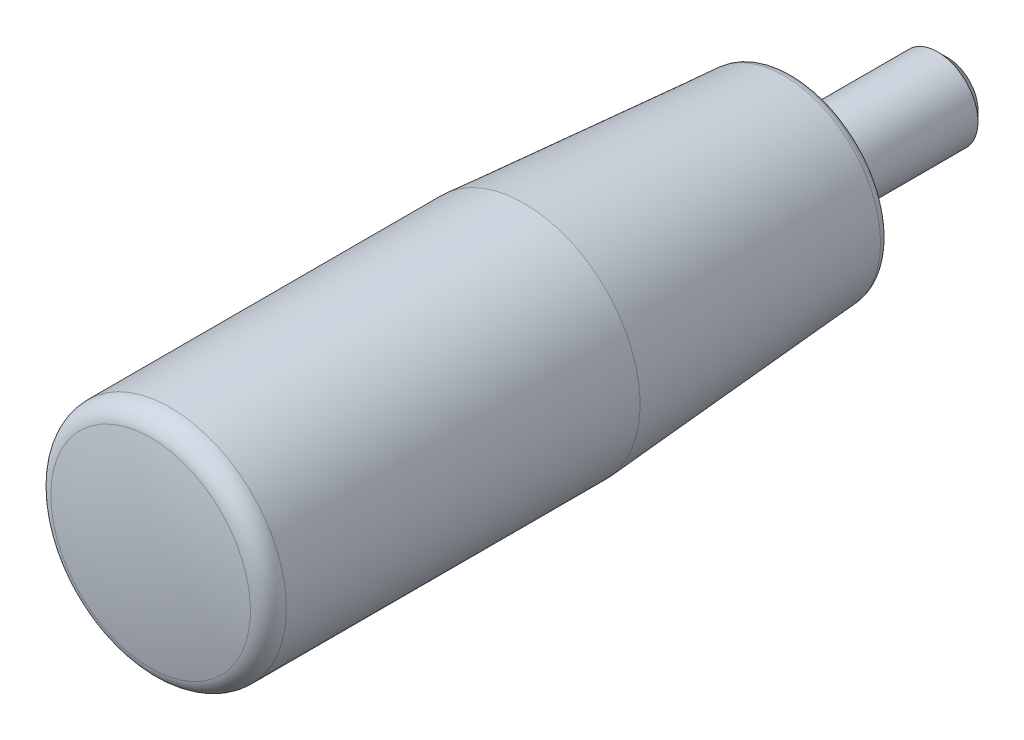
ISO-10303-21;
HEADER;
FILE_DESCRIPTION(('STEP AP214'),'2;1');
FILE_NAME('part.step','',(''),(''),'','','');
FILE_SCHEMA(('AUTOMOTIVE_DESIGN { 1 0 10303 214 1 1 1 1 }'));
ENDSEC;
DATA;
#1=APPLICATION_CONTEXT('core data for automotive mechanical design processes');
#2=APPLICATION_PROTOCOL_DEFINITION('international standard','automotive_design',2000,#1);
#3=PRODUCT_CONTEXT('',#1,'mechanical');
#4=PRODUCT('Part','Part','',(#3));
#5=PRODUCT_RELATED_PRODUCT_CATEGORY('part','',(#4));
#6=PRODUCT_DEFINITION_FORMATION('','',#4);
#7=PRODUCT_DEFINITION_CONTEXT('part definition',#1,'design');
#8=PRODUCT_DEFINITION('design','',#6,#7);
#9=PRODUCT_DEFINITION_SHAPE('','',#8);
#10=(LENGTH_UNIT() NAMED_UNIT(*) SI_UNIT(.MILLI.,.METRE.));
#11=(NAMED_UNIT(*) PLANE_ANGLE_UNIT() SI_UNIT($,.RADIAN.));
#12=(NAMED_UNIT(*) SI_UNIT($,.STERADIAN.) SOLID_ANGLE_UNIT());
#13=UNCERTAINTY_MEASURE_WITH_UNIT(LENGTH_MEASURE(1.E-05),#10,'distance_accuracy_value','');
#14=(GEOMETRIC_REPRESENTATION_CONTEXT(3) GLOBAL_UNCERTAINTY_ASSIGNED_CONTEXT((#13)) GLOBAL_UNIT_ASSIGNED_CONTEXT((#10,
#11,#12)) REPRESENTATION_CONTEXT('',''));
#15=CARTESIAN_POINT('',(0.,0.,0.));
#16=DIRECTION('',(0.,0.,1.));
#17=DIRECTION('',(1.,0.,0.));
#18=AXIS2_PLACEMENT_3D('',#15,#16,#17);
#19=CARTESIAN_POINT('',(0.,0.,62.050504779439));
#20=DIRECTION('',(0.,0.,-1.));
#21=DIRECTION('',(-1.,0.,0.));
#22=AXIS2_PLACEMENT_3D('',#19,#20,#21);
#23=TOROIDAL_SURFACE('',#22,9.5,2.);
#24=CARTESIAN_POINT('',(0.,0.,62.050504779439));
#25=DIRECTION('',(0.,0.,-1.));
#26=DIRECTION('',(-1.,0.,0.));
#27=AXIS2_PLACEMENT_3D('',#24,#25,#26);
#28=CIRCLE('',#27,11.5);
#29=CARTESIAN_POINT('',(-11.5,0.,62.050504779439));
#30=VERTEX_POINT('',#29);
#31=EDGE_CURVE('E142',#30,#30,#28,.T.);
#32=ORIENTED_EDGE('',*,*,#31,.F.);
#33=EDGE_LOOP('',(#32));
#34=FACE_BOUND('',#33,.T.);
#35=CARTESIAN_POINT('',(0.,0.,64.010942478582));
#36=DIRECTION('',(0.,0.,-1.));
#37=DIRECTION('',(-1.,0.,0.));
#38=AXIS2_PLACEMENT_3D('',#35,#36,#37);
#39=CIRCLE('',#38,9.89583333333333);
#40=CARTESIAN_POINT('',(-9.89583333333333,0.,64.010942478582));
#41=VERTEX_POINT('',#40);
#42=EDGE_CURVE('E116',#41,#41,#39,.T.);
#43=ORIENTED_EDGE('',*,*,#42,.T.);
#44=EDGE_LOOP('',(#43));
#45=FACE_BOUND('',#44,.T.);
#46=ADVANCED_FACE('F14',(#34,#45),#23,.T.);
#47=CARTESIAN_POINT('',(0.,0.,-20.));
#48=DIRECTION('',(0.,0.,-1.));
#49=DIRECTION('',(-1.,0.,0.));
#50=AXIS2_PLACEMENT_3D('',#47,#48,#49);
#51=CYLINDRICAL_SURFACE('',#50,11.5);
#52=CARTESIAN_POINT('',(0.,0.,27.));
#53=DIRECTION('',(0.,0.,-1.));
#54=DIRECTION('',(-1.,0.,0.));
#55=AXIS2_PLACEMENT_3D('',#52,#53,#54);
#56=CIRCLE('',#55,11.5);
#57=CARTESIAN_POINT('',(-11.5,0.,27.));
#58=VERTEX_POINT('',#57);
#59=EDGE_CURVE('E139',#58,#58,#56,.T.);
#60=ORIENTED_EDGE('',*,*,#59,.F.);
#61=EDGE_LOOP('',(#60));
#62=FACE_BOUND('',#61,.T.);
#63=ORIENTED_EDGE('',*,*,#31,.T.);
#64=EDGE_LOOP('',(#63));
#65=FACE_BOUND('',#64,.T.);
#66=ADVANCED_FACE('F165',(#62,#65),#51,.T.);
#67=CARTESIAN_POINT('',(0.,0.,1.22530100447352));
#68=DIRECTION('',(0.,0.,1.));
#69=DIRECTION('',(1.,0.,0.));
#70=AXIS2_PLACEMENT_3D('',#67,#68,#69);
#71=CONICAL_SURFACE('',#70,9.56931093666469,0.0747667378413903);
#72=ORIENTED_EDGE('',*,*,#59,.T.);
#73=EDGE_LOOP('',(#72));
#74=FACE_BOUND('',#73,.T.);
#75=CARTESIAN_POINT('',(0.,0.,1.22530100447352));
#76=DIRECTION('',(0.,0.,-1.));
#77=DIRECTION('',(-1.,0.,0.));
#78=AXIS2_PLACEMENT_3D('',#75,#76,#77);
#79=CIRCLE('',#78,9.56931093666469);
#80=CARTESIAN_POINT('',(-9.56931093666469,0.,1.22530100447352));
#81=VERTEX_POINT('',#80);
#82=EDGE_CURVE('E136',#81,#81,#79,.T.);
#83=ORIENTED_EDGE('',*,*,#82,.F.);
#84=EDGE_LOOP('',(#83));
#85=FACE_BOUND('',#84,.T.);
#86=ADVANCED_FACE('F171',(#74,#85),#71,.T.);
#87=CARTESIAN_POINT('',(0.,0.,1.3));
#88=DIRECTION('',(0.,0.,-1.));
#89=DIRECTION('',(-1.,0.,0.));
#90=AXIS2_PLACEMENT_3D('',#87,#88,#89);
#91=TOROIDAL_SURFACE('',#90,8.57210480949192,1.00000000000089);
#92=CARTESIAN_POINT('',(0.,0.,0.299999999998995));
#93=DIRECTION('',(0.,0.,-1.));
#94=DIRECTION('',(-1.,0.,0.));
#95=AXIS2_PLACEMENT_3D('',#92,#93,#94);
#96=CIRCLE('',#95,8.57210480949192);
#97=CARTESIAN_POINT('',(-8.57210480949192,0.,0.299999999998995));
#98=VERTEX_POINT('',#97);
#99=EDGE_CURVE('E133',#98,#98,#96,.T.);
#100=ORIENTED_EDGE('',*,*,#99,.F.);
#101=EDGE_LOOP('',(#100));
#102=FACE_BOUND('',#101,.T.);
#103=ORIENTED_EDGE('',*,*,#82,.T.);
#104=EDGE_LOOP('',(#103));
#105=FACE_BOUND('',#104,.T.);
#106=ADVANCED_FACE('F179',(#102,#105),#91,.T.);
#107=CARTESIAN_POINT('',(0.,6.,0.299999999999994));
#108=DIRECTION('',(0.,0.,-1.));
#109=DIRECTION('',(-1.,0.,0.));
#110=AXIS2_PLACEMENT_3D('',#107,#108,#109);
#111=PLANE('',#110);
#112=ORIENTED_EDGE('',*,*,#99,.T.);
#113=EDGE_LOOP('',(#112));
#114=FACE_BOUND('',#113,.T.);
#115=CARTESIAN_POINT('',(0.,0.,0.299999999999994));
#116=DIRECTION('',(0.,0.,-1.));
#117=DIRECTION('',(-1.,0.,0.));
#118=AXIS2_PLACEMENT_3D('',#115,#116,#117);
#119=CIRCLE('',#118,6.);
#120=CARTESIAN_POINT('',(-6.,0.,0.299999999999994));
#121=VERTEX_POINT('',#120);
#122=EDGE_CURVE('E130',#121,#121,#119,.T.);
#123=ORIENTED_EDGE('',*,*,#122,.F.);
#124=EDGE_LOOP('',(#123));
#125=FACE_BOUND('',#124,.T.);
#126=ADVANCED_FACE('F183',(#114,#125),#111,.T.);
#127=CARTESIAN_POINT('',(0.,0.,-20.));
#128=DIRECTION('',(0.,0.,-1.));
#129=DIRECTION('',(-1.,0.,0.));
#130=AXIS2_PLACEMENT_3D('',#127,#128,#129);
#131=CYLINDRICAL_SURFACE('',#130,6.);
#132=ORIENTED_EDGE('',*,*,#122,.T.);
#133=EDGE_LOOP('',(#132));
#134=FACE_BOUND('',#133,.T.);
#135=CARTESIAN_POINT('',(0.,0.,0.));
#136=DIRECTION('',(0.,0.,-1.));
#137=DIRECTION('',(-1.,0.,0.));
#138=AXIS2_PLACEMENT_3D('',#135,#136,#137);
#139=CIRCLE('',#138,6.);
#140=CARTESIAN_POINT('',(-6.,0.,0.));
#141=VERTEX_POINT('',#140);
#142=EDGE_CURVE('E127',#141,#141,#139,.T.);
#143=ORIENTED_EDGE('',*,*,#142,.F.);
#144=EDGE_LOOP('',(#143));
#145=FACE_BOUND('',#144,.T.);
#146=ADVANCED_FACE('F187',(#134,#145),#131,.T.);
#147=CARTESIAN_POINT('',(0.,6.,0.));
#148=DIRECTION('',(0.,0.,1.));
#149=DIRECTION('',(1.,0.,0.));
#150=AXIS2_PLACEMENT_3D('',#147,#148,#149);
#151=PLANE('',#150);
#152=CARTESIAN_POINT('',(0.,0.,0.));
#153=DIRECTION('',(0.,0.,-1.));
#154=DIRECTION('',(-1.,0.,0.));
#155=AXIS2_PLACEMENT_3D('',#152,#153,#154);
#156=CIRCLE('',#155,4.);
#157=CARTESIAN_POINT('',(-4.,0.,0.));
#158=VERTEX_POINT('',#157);
#159=EDGE_CURVE('E124',#158,#158,#156,.T.);
#160=ORIENTED_EDGE('',*,*,#159,.F.);
#161=EDGE_LOOP('',(#160));
#162=FACE_BOUND('',#161,.T.);
#163=ORIENTED_EDGE('',*,*,#142,.T.);
#164=EDGE_LOOP('',(#163));
#165=FACE_BOUND('',#164,.T.);
#166=ADVANCED_FACE('F191',(#162,#165),#151,.F.);
#167=CARTESIAN_POINT('',(0.,0.,-20.));
#168=DIRECTION('',(0.,0.,-1.));
#169=DIRECTION('',(-1.,0.,0.));
#170=AXIS2_PLACEMENT_3D('',#167,#168,#169);
#171=CYLINDRICAL_SURFACE('',#170,4.);
#172=CARTESIAN_POINT('',(0.,0.,-14.));
#173=DIRECTION('',(0.,0.,1.));
#174=DIRECTION('',(1.,0.,0.));
#175=AXIS2_PLACEMENT_3D('',#172,#173,#174);
#176=CIRCLE('',#175,4.);
#177=CARTESIAN_POINT('',(4.,0.,-14.));
#178=VERTEX_POINT('',#177);
#179=EDGE_CURVE('E9',#178,#178,#176,.T.);
#180=ORIENTED_EDGE('',*,*,#179,.T.);
#181=EDGE_LOOP('',(#180));
#182=FACE_BOUND('',#181,.T.);
#183=ORIENTED_EDGE('',*,*,#159,.T.);
#184=EDGE_LOOP('',(#183));
#185=FACE_BOUND('',#184,.T.);
#186=ADVANCED_FACE('F195',(#182,#185),#171,.T.);
#187=CARTESIAN_POINT('',(0.,4.,-15.));
#188=DIRECTION('',(0.,0.,1.));
#189=DIRECTION('',(1.,0.,0.));
#190=AXIS2_PLACEMENT_3D('',#187,#188,#189);
#191=PLANE('',#190);
#192=DIRECTION('',(-0.866025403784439,0.5,0.));
#193=VECTOR('',#192,1.);
#194=CARTESIAN_POINT('',(0.,-2.30940107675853,-15.));
#195=LINE('',#194,#193);
#196=CARTESIAN_POINT('',(0.,-2.30940107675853,-15.));
#197=VERTEX_POINT('',#196);
#198=CARTESIAN_POINT('',(-2.,-1.15470053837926,-15.));
#199=VERTEX_POINT('',#198);
#200=EDGE_CURVE('E103',#197,#199,#195,.T.);
#201=ORIENTED_EDGE('',*,*,#200,.F.);
#202=DIRECTION('',(-0.866025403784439,-0.5,0.));
#203=VECTOR('',#202,1.);
#204=CARTESIAN_POINT('',(2.,-1.15470053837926,-15.));
#205=LINE('',#204,#203);
#206=CARTESIAN_POINT('',(2.,-1.15470053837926,-15.));
#207=VERTEX_POINT('',#206);
#208=EDGE_CURVE('E29',#207,#197,#205,.T.);
#209=ORIENTED_EDGE('',*,*,#208,.F.);
#210=DIRECTION('',(0.,-1.,0.));
#211=VECTOR('',#210,1.);
#212=CARTESIAN_POINT('',(2.,1.15470053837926,-15.));
#213=LINE('',#212,#211);
#214=CARTESIAN_POINT('',(2.,1.15470053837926,-15.));
#215=VERTEX_POINT('',#214);
#216=EDGE_CURVE('E112',#215,#207,#213,.T.);
#217=ORIENTED_EDGE('',*,*,#216,.F.);
#218=DIRECTION('',(0.866025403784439,-0.5,0.));
#219=VECTOR('',#218,1.);
#220=CARTESIAN_POINT('',(0.,2.30940107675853,-15.));
#221=LINE('',#220,#219);
#222=CARTESIAN_POINT('',(0.,2.30940107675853,-15.));
#223=VERTEX_POINT('',#222);
#224=EDGE_CURVE('E110',#223,#215,#221,.T.);
#225=ORIENTED_EDGE('',*,*,#224,.F.);
#226=DIRECTION('',(0.866025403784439,0.5,0.));
#227=VECTOR('',#226,1.);
#228=CARTESIAN_POINT('',(-2.,1.15470053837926,-15.));
#229=LINE('',#228,#227);
#230=CARTESIAN_POINT('',(-2.,1.15470053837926,-15.));
#231=VERTEX_POINT('',#230);
#232=EDGE_CURVE('E77',#231,#223,#229,.T.);
#233=ORIENTED_EDGE('',*,*,#232,.F.);
#234=DIRECTION('',(0.,1.,0.));
#235=VECTOR('',#234,1.);
#236=CARTESIAN_POINT('',(-2.,-1.15470053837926,-15.));
#237=LINE('',#236,#235);
#238=EDGE_CURVE('E106',#199,#231,#237,.T.);
#239=ORIENTED_EDGE('',*,*,#238,.F.);
#240=EDGE_LOOP('',(#201,#209,#217,#225,#233,#239));
#241=FACE_BOUND('',#240,.T.);
#242=CARTESIAN_POINT('',(0.,0.,-15.));
#243=DIRECTION('',(0.,0.,1.));
#244=DIRECTION('',(1.,0.,0.));
#245=AXIS2_PLACEMENT_3D('',#242,#243,#244);
#246=CIRCLE('',#245,3.);
#247=CARTESIAN_POINT('',(3.,0.,-15.));
#248=VERTEX_POINT('',#247);
#249=EDGE_CURVE('E22',#248,#248,#246,.F.);
#250=ORIENTED_EDGE('',*,*,#249,.T.);
#251=EDGE_LOOP('',(#250));
#252=FACE_BOUND('',#251,.T.);
#253=ADVANCED_FACE('F147',(#241,#252),#191,.F.);
#254=CARTESIAN_POINT('',(0.,0.,15.));
#255=DIRECTION('',(-1.,0.,0.));
#256=DIRECTION('',(0.,0.,1.));
#257=AXIS2_PLACEMENT_3D('',#254,#255,#256);
#258=SPHERICAL_SURFACE('',#257,50.);
#259=CARTESIAN_POINT('',(0.,0.,15.));
#260=DIRECTION('',(0.,0.,-1.));
#261=DIRECTION('',(-1.,0.,0.));
#262=AXIS2_PLACEMENT_3D('',#259,#260,#261);
#263=SPHERICAL_SURFACE('',#262,50.);
#264=ORIENTED_EDGE('',*,*,#42,.F.);
#265=EDGE_LOOP('',(#264));
#266=FACE_BOUND('',#265,.T.);
#267=ADVANCED_FACE('F151',(#266),#263,.T.);
#268=CARTESIAN_POINT('',(0.,0.,-15.));
#269=DIRECTION('',(0.,0.,1.));
#270=DIRECTION('',(1.,0.,0.));
#271=AXIS2_PLACEMENT_3D('',#268,#269,#270);
#272=CONICAL_SURFACE('',#271,3.,0.785398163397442);
#273=ORIENTED_EDGE('',*,*,#179,.F.);
#274=EDGE_LOOP('',(#273));
#275=FACE_BOUND('',#274,.T.);
#276=ORIENTED_EDGE('',*,*,#249,.F.);
#277=EDGE_LOOP('',(#276));
#278=FACE_BOUND('',#277,.T.);
#279=ADVANCED_FACE('F16',(#275,#278),#272,.T.);
#280=CARTESIAN_POINT('',(2.,-1.15470053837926,-11.));
#281=DIRECTION('',(0.5,-0.866025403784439,0.));
#282=DIRECTION('',(0.866025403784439,0.5,0.));
#283=AXIS2_PLACEMENT_3D('',#280,#281,#282);
#284=PLANE('',#283);
#285=ORIENTED_EDGE('',*,*,#208,.T.);
#286=DIRECTION('',(0.,0.,-1.));
#287=VECTOR('',#286,1.);
#288=CARTESIAN_POINT('',(0.,-2.30940107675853,-11.));
#289=LINE('',#288,#287);
#290=CARTESIAN_POINT('',(0.,-2.30940107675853,-11.));
#291=VERTEX_POINT('',#290);
#292=EDGE_CURVE('E59',#291,#197,#289,.T.);
#293=ORIENTED_EDGE('',*,*,#292,.F.);
#294=DIRECTION('',(-0.866025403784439,-0.5,0.));
#295=VECTOR('',#294,1.);
#296=CARTESIAN_POINT('',(2.,-1.15470053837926,-11.));
#297=LINE('',#296,#295);
#298=CARTESIAN_POINT('',(2.,-1.15470053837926,-11.));
#299=VERTEX_POINT('',#298);
#300=EDGE_CURVE('E114',#299,#291,#297,.T.);
#301=ORIENTED_EDGE('',*,*,#300,.F.);
#302=DIRECTION('',(0.,0.,-1.));
#303=VECTOR('',#302,1.);
#304=CARTESIAN_POINT('',(2.,-1.15470053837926,-11.));
#305=LINE('',#304,#303);
#306=EDGE_CURVE('E37',#299,#207,#305,.T.);
#307=ORIENTED_EDGE('',*,*,#306,.T.);
#308=EDGE_LOOP('',(#285,#293,#301,#307));
#309=FACE_BOUND('',#308,.T.);
#310=ADVANCED_FACE('F150',(#309),#284,.F.);
#311=CARTESIAN_POINT('',(2.,1.15470053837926,-11.));
#312=DIRECTION('',(1.,0.,0.));
#313=DIRECTION('',(0.,0.,-1.));
#314=AXIS2_PLACEMENT_3D('',#311,#312,#313);
#315=PLANE('',#314);
#316=ORIENTED_EDGE('',*,*,#216,.T.);
#317=ORIENTED_EDGE('',*,*,#306,.F.);
#318=DIRECTION('',(0.,-1.,0.));
#319=VECTOR('',#318,1.);
#320=CARTESIAN_POINT('',(2.,1.15470053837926,-11.));
#321=LINE('',#320,#319);
#322=CARTESIAN_POINT('',(2.,1.15470053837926,-11.));
#323=VERTEX_POINT('',#322);
#324=EDGE_CURVE('E89',#323,#299,#321,.T.);
#325=ORIENTED_EDGE('',*,*,#324,.F.);
#326=DIRECTION('',(0.,0.,-1.));
#327=VECTOR('',#326,1.);
#328=CARTESIAN_POINT('',(2.,1.15470053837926,-11.));
#329=LINE('',#328,#327);
#330=EDGE_CURVE('E81',#323,#215,#329,.T.);
#331=ORIENTED_EDGE('',*,*,#330,.T.);
#332=EDGE_LOOP('',(#316,#317,#325,#331));
#333=FACE_BOUND('',#332,.T.);
#334=ADVANCED_FACE('F159',(#333),#315,.F.);
#335=CARTESIAN_POINT('',(0.,2.30940107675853,-11.));
#336=DIRECTION('',(0.5,0.866025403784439,0.));
#337=DIRECTION('',(-0.866025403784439,0.5,0.));
#338=AXIS2_PLACEMENT_3D('',#335,#336,#337);
#339=PLANE('',#338);
#340=ORIENTED_EDGE('',*,*,#224,.T.);
#341=ORIENTED_EDGE('',*,*,#330,.F.);
#342=DIRECTION('',(0.866025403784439,-0.5,0.));
#343=VECTOR('',#342,1.);
#344=CARTESIAN_POINT('',(0.,2.30940107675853,-11.));
#345=LINE('',#344,#343);
#346=CARTESIAN_POINT('',(0.,2.30940107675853,-11.));
#347=VERTEX_POINT('',#346);
#348=EDGE_CURVE('E85',#347,#323,#345,.T.);
#349=ORIENTED_EDGE('',*,*,#348,.F.);
#350=DIRECTION('',(0.,0.,-1.));
#351=VECTOR('',#350,1.);
#352=CARTESIAN_POINT('',(0.,2.30940107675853,-11.));
#353=LINE('',#352,#351);
#354=EDGE_CURVE('E70',#347,#223,#353,.T.);
#355=ORIENTED_EDGE('',*,*,#354,.T.);
#356=EDGE_LOOP('',(#340,#341,#349,#355));
#357=FACE_BOUND('',#356,.T.);
#358=ADVANCED_FACE('F86',(#357),#339,.F.);
#359=CARTESIAN_POINT('',(-2.,1.15470053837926,-11.));
#360=DIRECTION('',(-0.5,0.866025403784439,0.));
#361=DIRECTION('',(-0.866025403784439,-0.5,0.));
#362=AXIS2_PLACEMENT_3D('',#359,#360,#361);
#363=PLANE('',#362);
#364=ORIENTED_EDGE('',*,*,#232,.T.);
#365=ORIENTED_EDGE('',*,*,#354,.F.);
#366=DIRECTION('',(0.866025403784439,0.5,0.));
#367=VECTOR('',#366,1.);
#368=CARTESIAN_POINT('',(-2.,1.15470053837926,-11.));
#369=LINE('',#368,#367);
#370=CARTESIAN_POINT('',(-2.,1.15470053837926,-11.));
#371=VERTEX_POINT('',#370);
#372=EDGE_CURVE('E74',#371,#347,#369,.T.);
#373=ORIENTED_EDGE('',*,*,#372,.F.);
#374=DIRECTION('',(0.,0.,-1.));
#375=VECTOR('',#374,1.);
#376=CARTESIAN_POINT('',(-2.,1.15470053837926,-11.));
#377=LINE('',#376,#375);
#378=EDGE_CURVE('E82',#371,#231,#377,.T.);
#379=ORIENTED_EDGE('',*,*,#378,.T.);
#380=EDGE_LOOP('',(#364,#365,#373,#379));
#381=FACE_BOUND('',#380,.T.);
#382=ADVANCED_FACE('F72',(#381),#363,.F.);
#383=CARTESIAN_POINT('',(-2.,-1.15470053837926,-11.));
#384=DIRECTION('',(-1.,0.,0.));
#385=DIRECTION('',(0.,-1.,0.));
#386=AXIS2_PLACEMENT_3D('',#383,#384,#385);
#387=PLANE('',#386);
#388=ORIENTED_EDGE('',*,*,#238,.T.);
#389=ORIENTED_EDGE('',*,*,#378,.F.);
#390=DIRECTION('',(0.,1.,0.));
#391=VECTOR('',#390,1.);
#392=CARTESIAN_POINT('',(-2.,-1.15470053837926,-11.));
#393=LINE('',#392,#391);
#394=CARTESIAN_POINT('',(-2.,-1.15470053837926,-11.));
#395=VERTEX_POINT('',#394);
#396=EDGE_CURVE('E95',#395,#371,#393,.T.);
#397=ORIENTED_EDGE('',*,*,#396,.F.);
#398=DIRECTION('',(0.,0.,-1.));
#399=VECTOR('',#398,1.);
#400=CARTESIAN_POINT('',(-2.,-1.15470053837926,-11.));
#401=LINE('',#400,#399);
#402=EDGE_CURVE('E119',#395,#199,#401,.T.);
#403=ORIENTED_EDGE('',*,*,#402,.T.);
#404=EDGE_LOOP('',(#388,#389,#397,#403));
#405=FACE_BOUND('',#404,.T.);
#406=ADVANCED_FACE('F206',(#405),#387,.F.);
#407=CARTESIAN_POINT('',(0.,-2.30940107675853,-11.));
#408=DIRECTION('',(-0.5,-0.866025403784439,0.));
#409=DIRECTION('',(0.866025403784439,-0.5,0.));
#410=AXIS2_PLACEMENT_3D('',#407,#408,#409);
#411=PLANE('',#410);
#412=ORIENTED_EDGE('',*,*,#200,.T.);
#413=ORIENTED_EDGE('',*,*,#402,.F.);
#414=DIRECTION('',(-0.866025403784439,0.5,0.));
#415=VECTOR('',#414,1.);
#416=CARTESIAN_POINT('',(0.,-2.30940107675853,-11.));
#417=LINE('',#416,#415);
#418=EDGE_CURVE('E97',#291,#395,#417,.T.);
#419=ORIENTED_EDGE('',*,*,#418,.F.);
#420=ORIENTED_EDGE('',*,*,#292,.T.);
#421=EDGE_LOOP('',(#412,#413,#419,#420));
#422=FACE_BOUND('',#421,.T.);
#423=ADVANCED_FACE('F203',(#422),#411,.F.);
#424=CARTESIAN_POINT('',(0.,-2.30940107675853,-11.));
#425=DIRECTION('',(0.,0.,-1.));
#426=DIRECTION('',(-1.,0.,0.));
#427=AXIS2_PLACEMENT_3D('',#424,#425,#426);
#428=PLANE('',#427);
#429=ORIENTED_EDGE('',*,*,#300,.T.);
#430=ORIENTED_EDGE('',*,*,#418,.T.);
#431=ORIENTED_EDGE('',*,*,#396,.T.);
#432=ORIENTED_EDGE('',*,*,#372,.T.);
#433=ORIENTED_EDGE('',*,*,#348,.T.);
#434=ORIENTED_EDGE('',*,*,#324,.T.);
#435=EDGE_LOOP('',(#429,#430,#431,#432,#433,#434));
#436=FACE_BOUND('',#435,.T.);
#437=ADVANCED_FACE('F92',(#436),#428,.T.);
#438=CLOSED_SHELL('',(#46,#66,#86,#106,#126,#146,#166,#186,#253,#267,#279,#310,#334,#358,#382,
#406,#423,#437));
#439=MANIFOLD_SOLID_BREP('B1',#438);
#440=ADVANCED_BREP_SHAPE_REPRESENTATION('',(#18,#439),#14);
#441=SHAPE_DEFINITION_REPRESENTATION(#9,#440);
ENDSEC;
END-ISO-10303-21;
